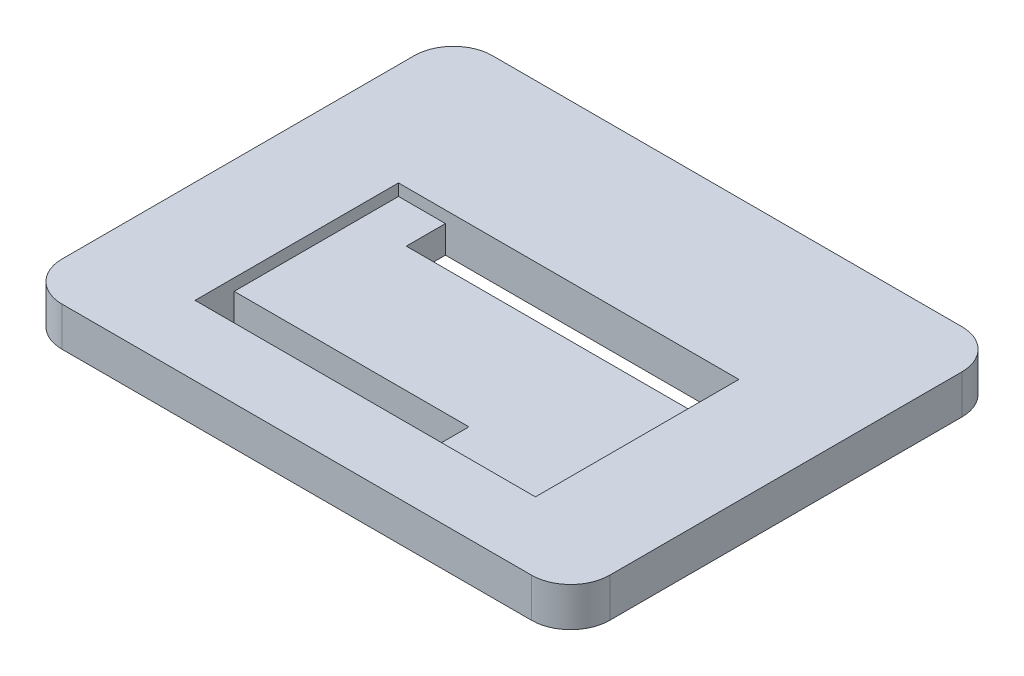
ISO-10303-21;
HEADER;
FILE_DESCRIPTION(('STEP AP214'),'2;1');
FILE_NAME('part.step','',(''),(''),'','','');
FILE_SCHEMA(('AUTOMOTIVE_DESIGN { 1 0 10303 214 1 1 1 1 }'));
ENDSEC;
DATA;
#1=APPLICATION_CONTEXT('core data for automotive mechanical design processes');
#2=APPLICATION_PROTOCOL_DEFINITION('international standard','automotive_design',2000,#1);
#3=PRODUCT_CONTEXT('',#1,'mechanical');
#4=PRODUCT('Part','Part','',(#3));
#5=PRODUCT_RELATED_PRODUCT_CATEGORY('part','',(#4));
#6=PRODUCT_DEFINITION_FORMATION('','',#4);
#7=PRODUCT_DEFINITION_CONTEXT('part definition',#1,'design');
#8=PRODUCT_DEFINITION('design','',#6,#7);
#9=PRODUCT_DEFINITION_SHAPE('','',#8);
#10=(LENGTH_UNIT() NAMED_UNIT(*) SI_UNIT(.MILLI.,.METRE.));
#11=(NAMED_UNIT(*) PLANE_ANGLE_UNIT() SI_UNIT($,.RADIAN.));
#12=(NAMED_UNIT(*) SI_UNIT($,.STERADIAN.) SOLID_ANGLE_UNIT());
#13=UNCERTAINTY_MEASURE_WITH_UNIT(LENGTH_MEASURE(1.E-05),#10,'distance_accuracy_value','');
#14=(GEOMETRIC_REPRESENTATION_CONTEXT(3) GLOBAL_UNCERTAINTY_ASSIGNED_CONTEXT((#13)) GLOBAL_UNIT_ASSIGNED_CONTEXT((#10,
#11,#12)) REPRESENTATION_CONTEXT('',''));
#15=CARTESIAN_POINT('',(0.,0.,0.));
#16=DIRECTION('',(0.,0.,1.));
#17=DIRECTION('',(1.,0.,0.));
#18=AXIS2_PLACEMENT_3D('',#15,#16,#17);
#19=CARTESIAN_POINT('',(-71.0763192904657,10.,-36.9348558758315));
#20=DIRECTION('',(1.,0.,0.));
#21=DIRECTION('',(0.,0.,-1.));
#22=AXIS2_PLACEMENT_3D('',#19,#20,#21);
#23=PLANE('',#22);
#24=DIRECTION('',(0.,0.,1.));
#25=VECTOR('',#24,1.);
#26=CARTESIAN_POINT('',(-71.0763192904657,0.,-36.9348558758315));
#27=LINE('',#26,#25);
#28=CARTESIAN_POINT('',(-71.0763192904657,0.,-26.9348558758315));
#29=VERTEX_POINT('',#28);
#30=CARTESIAN_POINT('',(-71.0763192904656,0.,63.0651441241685));
#31=VERTEX_POINT('',#30);
#32=EDGE_CURVE('E228',#29,#31,#27,.T.);
#33=ORIENTED_EDGE('',*,*,#32,.T.);
#34=DIRECTION('',(0.,-1.,0.));
#35=VECTOR('',#34,1.);
#36=CARTESIAN_POINT('',(-71.0763192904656,10.,63.0651441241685));
#37=LINE('',#36,#35);
#38=CARTESIAN_POINT('',(-71.0763192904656,10.,63.0651441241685));
#39=VERTEX_POINT('',#38);
#40=EDGE_CURVE('E291',#31,#39,#37,.F.);
#41=ORIENTED_EDGE('',*,*,#40,.T.);
#42=DIRECTION('',(0.,0.,1.));
#43=VECTOR('',#42,1.);
#44=CARTESIAN_POINT('',(-71.0763192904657,10.,-36.9348558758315));
#45=LINE('',#44,#43);
#46=CARTESIAN_POINT('',(-71.0763192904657,10.,-26.9348558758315));
#47=VERTEX_POINT('',#46);
#48=EDGE_CURVE('E237',#47,#39,#45,.T.);
#49=ORIENTED_EDGE('',*,*,#48,.F.);
#50=DIRECTION('',(0.,-1.,0.));
#51=VECTOR('',#50,1.);
#52=CARTESIAN_POINT('',(-71.0763192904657,10.,-26.9348558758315));
#53=LINE('',#52,#51);
#54=EDGE_CURVE('E287',#47,#29,#53,.T.);
#55=ORIENTED_EDGE('',*,*,#54,.T.);
#56=EDGE_LOOP('',(#33,#41,#49,#55));
#57=FACE_BOUND('',#56,.T.);
#58=ADVANCED_FACE('F43',(#57),#23,.F.);
#59=CARTESIAN_POINT('',(-71.0763192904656,10.,73.0651441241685));
#60=DIRECTION('',(0.,0.,-1.));
#61=DIRECTION('',(-1.,0.,0.));
#62=AXIS2_PLACEMENT_3D('',#59,#60,#61);
#63=PLANE('',#62);
#64=DIRECTION('',(1.,0.,0.));
#65=VECTOR('',#64,1.);
#66=CARTESIAN_POINT('',(-71.0763192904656,10.,73.0651441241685));
#67=LINE('',#66,#65);
#68=CARTESIAN_POINT('',(-61.0763192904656,10.,73.0651441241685));
#69=VERTEX_POINT('',#68);
#70=CARTESIAN_POINT('',(58.9036807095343,10.,73.0651441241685));
#71=VERTEX_POINT('',#70);
#72=EDGE_CURVE('E241',#69,#71,#67,.T.);
#73=ORIENTED_EDGE('',*,*,#72,.F.);
#74=DIRECTION('',(0.,-1.,0.));
#75=VECTOR('',#74,1.);
#76=CARTESIAN_POINT('',(-61.0763192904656,10.,73.0651441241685));
#77=LINE('',#76,#75);
#78=CARTESIAN_POINT('',(-61.0763192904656,0.,73.0651441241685));
#79=VERTEX_POINT('',#78);
#80=EDGE_CURVE('E271',#69,#79,#77,.T.);
#81=ORIENTED_EDGE('',*,*,#80,.T.);
#82=DIRECTION('',(1.,0.,0.));
#83=VECTOR('',#82,1.);
#84=CARTESIAN_POINT('',(-71.0763192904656,0.,73.0651441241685));
#85=LINE('',#84,#83);
#86=CARTESIAN_POINT('',(58.9036807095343,0.,73.0651441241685));
#87=VERTEX_POINT('',#86);
#88=EDGE_CURVE('E258',#79,#87,#85,.T.);
#89=ORIENTED_EDGE('',*,*,#88,.T.);
#90=DIRECTION('',(0.,-1.,0.));
#91=VECTOR('',#90,1.);
#92=CARTESIAN_POINT('',(58.9036807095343,10.,73.0651441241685));
#93=LINE('',#92,#91);
#94=EDGE_CURVE('E254',#87,#71,#93,.F.);
#95=ORIENTED_EDGE('',*,*,#94,.T.);
#96=EDGE_LOOP('',(#73,#81,#89,#95));
#97=FACE_BOUND('',#96,.T.);
#98=ADVANCED_FACE('F429',(#97),#63,.F.);
#99=CARTESIAN_POINT('',(68.9036807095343,10.,-36.9348558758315));
#100=DIRECTION('',(-1.,0.,0.));
#101=DIRECTION('',(0.,0.,1.));
#102=AXIS2_PLACEMENT_3D('',#99,#100,#101);
#103=PLANE('',#102);
#104=DIRECTION('',(0.,0.,-1.));
#105=VECTOR('',#104,1.);
#106=CARTESIAN_POINT('',(68.9036807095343,0.,-36.9348558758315));
#107=LINE('',#106,#105);
#108=CARTESIAN_POINT('',(68.9036807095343,0.,63.0651441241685));
#109=VERTEX_POINT('',#108);
#110=CARTESIAN_POINT('',(68.9036807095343,0.,-26.9348558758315));
#111=VERTEX_POINT('',#110);
#112=EDGE_CURVE('E262',#109,#111,#107,.T.);
#113=ORIENTED_EDGE('',*,*,#112,.T.);
#114=DIRECTION('',(0.,-1.,0.));
#115=VECTOR('',#114,1.);
#116=CARTESIAN_POINT('',(68.9036807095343,10.,-26.9348558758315));
#117=LINE('',#116,#115);
#118=CARTESIAN_POINT('',(68.9036807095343,10.,-26.9348558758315));
#119=VERTEX_POINT('',#118);
#120=EDGE_CURVE('E317',#111,#119,#117,.F.);
#121=ORIENTED_EDGE('',*,*,#120,.T.);
#122=DIRECTION('',(0.,0.,-1.));
#123=VECTOR('',#122,1.);
#124=CARTESIAN_POINT('',(68.9036807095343,10.,-36.9348558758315));
#125=LINE('',#124,#123);
#126=CARTESIAN_POINT('',(68.9036807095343,10.,63.0651441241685));
#127=VERTEX_POINT('',#126);
#128=EDGE_CURVE('E246',#127,#119,#125,.T.);
#129=ORIENTED_EDGE('',*,*,#128,.F.);
#130=DIRECTION('',(0.,-1.,0.));
#131=VECTOR('',#130,1.);
#132=CARTESIAN_POINT('',(68.9036807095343,10.,63.0651441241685));
#133=LINE('',#132,#131);
#134=EDGE_CURVE('E313',#127,#109,#133,.T.);
#135=ORIENTED_EDGE('',*,*,#134,.T.);
#136=EDGE_LOOP('',(#113,#121,#129,#135));
#137=FACE_BOUND('',#136,.T.);
#138=ADVANCED_FACE('F435',(#137),#103,.F.);
#139=CARTESIAN_POINT('',(-71.0763192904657,10.,-36.9348558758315));
#140=DIRECTION('',(0.,0.,1.));
#141=DIRECTION('',(1.,0.,0.));
#142=AXIS2_PLACEMENT_3D('',#139,#140,#141);
#143=PLANE('',#142);
#144=DIRECTION('',(-1.,0.,0.));
#145=VECTOR('',#144,1.);
#146=CARTESIAN_POINT('',(-71.0763192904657,0.,-36.9348558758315));
#147=LINE('',#146,#145);
#148=CARTESIAN_POINT('',(58.9036807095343,0.,-36.9348558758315));
#149=VERTEX_POINT('',#148);
#150=CARTESIAN_POINT('',(-61.0763192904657,0.,-36.9348558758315));
#151=VERTEX_POINT('',#150);
#152=EDGE_CURVE('E242',#149,#151,#147,.T.);
#153=ORIENTED_EDGE('',*,*,#152,.T.);
#154=DIRECTION('',(0.,-1.,0.));
#155=VECTOR('',#154,1.);
#156=CARTESIAN_POINT('',(-61.0763192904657,10.,-36.9348558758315));
#157=LINE('',#156,#155);
#158=CARTESIAN_POINT('',(-61.0763192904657,10.,-36.9348558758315));
#159=VERTEX_POINT('',#158);
#160=EDGE_CURVE('E310',#151,#159,#157,.F.);
#161=ORIENTED_EDGE('',*,*,#160,.T.);
#162=DIRECTION('',(-1.,0.,0.));
#163=VECTOR('',#162,1.);
#164=CARTESIAN_POINT('',(-71.0763192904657,10.,-36.9348558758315));
#165=LINE('',#164,#163);
#166=CARTESIAN_POINT('',(58.9036807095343,10.,-36.9348558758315));
#167=VERTEX_POINT('',#166);
#168=EDGE_CURVE('E250',#167,#159,#165,.T.);
#169=ORIENTED_EDGE('',*,*,#168,.F.);
#170=DIRECTION('',(0.,-1.,0.));
#171=VECTOR('',#170,1.);
#172=CARTESIAN_POINT('',(58.9036807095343,10.,-36.9348558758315));
#173=LINE('',#172,#171);
#174=EDGE_CURVE('E306',#167,#149,#173,.T.);
#175=ORIENTED_EDGE('',*,*,#174,.T.);
#176=EDGE_LOOP('',(#153,#161,#169,#175));
#177=FACE_BOUND('',#176,.T.);
#178=ADVANCED_FACE('F461',(#177),#143,.F.);
#179=CARTESIAN_POINT('',(0.,10.,0.));
#180=DIRECTION('',(0.,1.,0.));
#181=DIRECTION('',(0.,0.,1.));
#182=AXIS2_PLACEMENT_3D('',#179,#180,#181);
#183=PLANE('',#182);
#184=DIRECTION('',(1.,0.,0.));
#185=VECTOR('',#184,1.);
#186=CARTESIAN_POINT('',(-44.9244531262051,10.,55.2378384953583));
#187=LINE('',#186,#185);
#188=CARTESIAN_POINT('',(-44.9244531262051,10.,55.2378384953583));
#189=VERTEX_POINT('',#188);
#190=CARTESIAN_POINT('',(42.0755468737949,10.,55.2378384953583));
#191=VERTEX_POINT('',#190);
#192=EDGE_CURVE('E214',#189,#191,#187,.T.);
#193=ORIENTED_EDGE('',*,*,#192,.F.);
#194=DIRECTION('',(0.,0.,1.));
#195=VECTOR('',#194,1.);
#196=CARTESIAN_POINT('',(-44.9244531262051,10.,3.23783849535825));
#197=LINE('',#196,#195);
#198=CARTESIAN_POINT('',(-44.9244531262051,10.,3.23783849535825));
#199=VERTEX_POINT('',#198);
#200=EDGE_CURVE('E197',#199,#189,#197,.T.);
#201=ORIENTED_EDGE('',*,*,#200,.F.);
#202=DIRECTION('',(-1.,0.,0.));
#203=VECTOR('',#202,1.);
#204=CARTESIAN_POINT('',(-1.0863192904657,10.,3.23783849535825));
#205=LINE('',#204,#203);
#206=CARTESIAN_POINT('',(42.0755468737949,10.,3.23783849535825));
#207=VERTEX_POINT('',#206);
#208=EDGE_CURVE('E204',#207,#199,#205,.T.);
#209=ORIENTED_EDGE('',*,*,#208,.F.);
#210=DIRECTION('',(0.,0.,-1.));
#211=VECTOR('',#210,1.);
#212=CARTESIAN_POINT('',(42.0755468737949,10.,55.2378384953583));
#213=LINE('',#212,#211);
#214=EDGE_CURVE('E217',#191,#207,#213,.T.);
#215=ORIENTED_EDGE('',*,*,#214,.F.);
#216=EDGE_LOOP('',(#193,#201,#209,#215));
#217=FACE_BOUND('',#216,.T.);
#218=ORIENTED_EDGE('',*,*,#48,.T.);
#219=CARTESIAN_POINT('',(-61.0763192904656,10.,63.0651441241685));
#220=DIRECTION('',(0.,1.,0.));
#221=DIRECTION('',(0.,0.,1.));
#222=AXIS2_PLACEMENT_3D('',#219,#220,#221);
#223=CIRCLE('',#222,10.);
#224=EDGE_CURVE('E303',#39,#69,#223,.T.);
#225=ORIENTED_EDGE('',*,*,#224,.T.);
#226=ORIENTED_EDGE('',*,*,#72,.T.);
#227=CARTESIAN_POINT('',(58.9036807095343,10.,63.0651441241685));
#228=DIRECTION('',(0.,1.,0.));
#229=DIRECTION('',(0.,0.,1.));
#230=AXIS2_PLACEMENT_3D('',#227,#228,#229);
#231=CIRCLE('',#230,10.);
#232=EDGE_CURVE('E294',#71,#127,#231,.T.);
#233=ORIENTED_EDGE('',*,*,#232,.T.);
#234=ORIENTED_EDGE('',*,*,#128,.T.);
#235=CARTESIAN_POINT('',(58.9036807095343,10.,-26.9348558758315));
#236=DIRECTION('',(0.,1.,0.));
#237=DIRECTION('',(0.,0.,1.));
#238=AXIS2_PLACEMENT_3D('',#235,#236,#237);
#239=CIRCLE('',#238,10.);
#240=EDGE_CURVE('E297',#119,#167,#239,.T.);
#241=ORIENTED_EDGE('',*,*,#240,.T.);
#242=ORIENTED_EDGE('',*,*,#168,.T.);
#243=CARTESIAN_POINT('',(-61.0763192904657,10.,-26.9348558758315));
#244=DIRECTION('',(0.,1.,0.));
#245=DIRECTION('',(0.,0.,1.));
#246=AXIS2_PLACEMENT_3D('',#243,#244,#245);
#247=CIRCLE('',#246,10.);
#248=EDGE_CURVE('E300',#159,#47,#247,.T.);
#249=ORIENTED_EDGE('',*,*,#248,.T.);
#250=EDGE_LOOP('',(#218,#225,#226,#233,#234,#241,#242,#249));
#251=FACE_BOUND('',#250,.T.);
#252=ADVANCED_FACE('F409',(#217,#251),#183,.T.);
#253=CARTESIAN_POINT('',(0.,0.,0.));
#254=DIRECTION('',(0.,1.,0.));
#255=DIRECTION('',(0.,0.,1.));
#256=AXIS2_PLACEMENT_3D('',#253,#254,#255);
#257=PLANE('',#256);
#258=CARTESIAN_POINT('',(-64.6118531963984,0.,-30.4703897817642));
#259=DIRECTION('',(0.,-1.,0.));
#260=DIRECTION('',(0.,0.,-1.));
#261=AXIS2_PLACEMENT_3D('',#258,#259,#260);
#262=CIRCLE('',#261,3.5);
#263=CARTESIAN_POINT('',(-64.6118531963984,0.,-33.9703897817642));
#264=VERTEX_POINT('',#263);
#265=EDGE_CURVE('E384',#264,#264,#262,.T.);
#266=ORIENTED_EDGE('',*,*,#265,.F.);
#267=EDGE_LOOP('',(#266));
#268=FACE_BOUND('',#267,.T.);
#269=CARTESIAN_POINT('',(62.439214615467,0.,-30.4703897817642));
#270=DIRECTION('',(0.,-1.,0.));
#271=DIRECTION('',(0.,0.,-1.));
#272=AXIS2_PLACEMENT_3D('',#269,#270,#271);
#273=CIRCLE('',#272,3.49999999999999);
#274=CARTESIAN_POINT('',(62.439214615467,0.,-33.9703897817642));
#275=VERTEX_POINT('',#274);
#276=EDGE_CURVE('E392',#275,#275,#273,.T.);
#277=ORIENTED_EDGE('',*,*,#276,.F.);
#278=EDGE_LOOP('',(#277));
#279=FACE_BOUND('',#278,.T.);
#280=CARTESIAN_POINT('',(62.439214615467,0.,66.6006780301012));
#281=DIRECTION('',(0.,-1.,0.));
#282=DIRECTION('',(0.,0.,-1.));
#283=AXIS2_PLACEMENT_3D('',#280,#281,#282);
#284=CIRCLE('',#283,3.50000000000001);
#285=CARTESIAN_POINT('',(62.439214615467,0.,63.1006780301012));
#286=VERTEX_POINT('',#285);
#287=EDGE_CURVE('E376',#286,#286,#284,.T.);
#288=ORIENTED_EDGE('',*,*,#287,.F.);
#289=EDGE_LOOP('',(#288));
#290=FACE_BOUND('',#289,.T.);
#291=CARTESIAN_POINT('',(-64.6118531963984,0.,66.6006780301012));
#292=DIRECTION('',(0.,-1.,0.));
#293=DIRECTION('',(0.,0.,-1.));
#294=AXIS2_PLACEMENT_3D('',#291,#292,#293);
#295=CIRCLE('',#294,3.5);
#296=CARTESIAN_POINT('',(-64.6118531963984,0.,63.1006780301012));
#297=VERTEX_POINT('',#296);
#298=EDGE_CURVE('E372',#297,#297,#295,.T.);
#299=ORIENTED_EDGE('',*,*,#298,.F.);
#300=EDGE_LOOP('',(#299));
#301=FACE_BOUND('',#300,.T.);
#302=DIRECTION('',(-1.,0.,0.));
#303=VECTOR('',#302,1.);
#304=CARTESIAN_POINT('',(0.,0.,45.2378384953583));
#305=LINE('',#304,#303);
#306=CARTESIAN_POINT('',(15.0755468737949,0.,45.2378384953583));
#307=VERTEX_POINT('',#306);
#308=CARTESIAN_POINT('',(-44.9244531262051,0.,45.2378384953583));
#309=VERTEX_POINT('',#308);
#310=EDGE_CURVE('E52',#307,#309,#305,.T.);
#311=ORIENTED_EDGE('',*,*,#310,.T.);
#312=DIRECTION('',(0.,0.,1.));
#313=VECTOR('',#312,1.);
#314=CARTESIAN_POINT('',(-44.9244531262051,0.,0.));
#315=LINE('',#314,#313);
#316=CARTESIAN_POINT('',(-44.9244531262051,0.,55.2378384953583));
#317=VERTEX_POINT('',#316);
#318=EDGE_CURVE('E11',#309,#317,#315,.T.);
#319=ORIENTED_EDGE('',*,*,#318,.T.);
#320=DIRECTION('',(1.,0.,0.));
#321=VECTOR('',#320,1.);
#322=CARTESIAN_POINT('',(0.,0.,55.2378384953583));
#323=LINE('',#322,#321);
#324=CARTESIAN_POINT('',(15.0755468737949,0.,55.2378384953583));
#325=VERTEX_POINT('',#324);
#326=EDGE_CURVE('E336',#317,#325,#323,.T.);
#327=ORIENTED_EDGE('',*,*,#326,.T.);
#328=DIRECTION('',(0.,0.,-1.));
#329=VECTOR('',#328,1.);
#330=CARTESIAN_POINT('',(15.0755468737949,0.,0.));
#331=LINE('',#330,#329);
#332=EDGE_CURVE('E172',#325,#307,#331,.T.);
#333=ORIENTED_EDGE('',*,*,#332,.T.);
#334=EDGE_LOOP('',(#311,#319,#327,#333));
#335=FACE_BOUND('',#334,.T.);
#336=DIRECTION('',(1.,0.,0.));
#337=VECTOR('',#336,1.);
#338=CARTESIAN_POINT('',(0.,0.,13.2378384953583));
#339=LINE('',#338,#337);
#340=CARTESIAN_POINT('',(-32.9244531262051,0.,13.2378384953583));
#341=VERTEX_POINT('',#340);
#342=CARTESIAN_POINT('',(42.0755468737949,0.,13.2378384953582));
#343=VERTEX_POINT('',#342);
#344=EDGE_CURVE('E328',#341,#343,#339,.T.);
#345=ORIENTED_EDGE('',*,*,#344,.T.);
#346=DIRECTION('',(0.,0.,-1.));
#347=VECTOR('',#346,1.);
#348=CARTESIAN_POINT('',(42.0755468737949,0.,0.));
#349=LINE('',#348,#347);
#350=CARTESIAN_POINT('',(42.0755468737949,0.,3.23783849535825));
#351=VERTEX_POINT('',#350);
#352=EDGE_CURVE('E332',#343,#351,#349,.T.);
#353=ORIENTED_EDGE('',*,*,#352,.T.);
#354=DIRECTION('',(-1.,0.,0.));
#355=VECTOR('',#354,1.);
#356=CARTESIAN_POINT('',(0.,0.,3.23783849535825));
#357=LINE('',#356,#355);
#358=CARTESIAN_POINT('',(-32.9244531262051,0.,3.23783849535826));
#359=VERTEX_POINT('',#358);
#360=EDGE_CURVE('E320',#351,#359,#357,.T.);
#361=ORIENTED_EDGE('',*,*,#360,.T.);
#362=DIRECTION('',(0.,0.,1.));
#363=VECTOR('',#362,1.);
#364=CARTESIAN_POINT('',(-32.9244531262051,0.,0.));
#365=LINE('',#364,#363);
#366=EDGE_CURVE('E324',#359,#341,#365,.T.);
#367=ORIENTED_EDGE('',*,*,#366,.T.);
#368=EDGE_LOOP('',(#345,#353,#361,#367));
#369=FACE_BOUND('',#368,.T.);
#370=ORIENTED_EDGE('',*,*,#88,.F.);
#371=CARTESIAN_POINT('',(-61.0763192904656,0.,63.0651441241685));
#372=DIRECTION('',(0.,1.,0.));
#373=DIRECTION('',(0.,0.,1.));
#374=AXIS2_PLACEMENT_3D('',#371,#372,#373);
#375=CIRCLE('',#374,10.);
#376=EDGE_CURVE('E284',#79,#31,#375,.F.);
#377=ORIENTED_EDGE('',*,*,#376,.T.);
#378=ORIENTED_EDGE('',*,*,#32,.F.);
#379=CARTESIAN_POINT('',(-61.0763192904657,0.,-26.9348558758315));
#380=DIRECTION('',(0.,1.,0.));
#381=DIRECTION('',(0.,0.,1.));
#382=AXIS2_PLACEMENT_3D('',#379,#380,#381);
#383=CIRCLE('',#382,10.);
#384=EDGE_CURVE('E281',#29,#151,#383,.F.);
#385=ORIENTED_EDGE('',*,*,#384,.T.);
#386=ORIENTED_EDGE('',*,*,#152,.F.);
#387=CARTESIAN_POINT('',(58.9036807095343,0.,-26.9348558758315));
#388=DIRECTION('',(0.,1.,0.));
#389=DIRECTION('',(0.,0.,1.));
#390=AXIS2_PLACEMENT_3D('',#387,#388,#389);
#391=CIRCLE('',#390,10.);
#392=EDGE_CURVE('E278',#149,#111,#391,.F.);
#393=ORIENTED_EDGE('',*,*,#392,.T.);
#394=ORIENTED_EDGE('',*,*,#112,.F.);
#395=CARTESIAN_POINT('',(58.9036807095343,0.,63.0651441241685));
#396=DIRECTION('',(0.,1.,0.));
#397=DIRECTION('',(0.,0.,1.));
#398=AXIS2_PLACEMENT_3D('',#395,#396,#397);
#399=CIRCLE('',#398,10.);
#400=EDGE_CURVE('E275',#109,#87,#399,.F.);
#401=ORIENTED_EDGE('',*,*,#400,.T.);
#402=EDGE_LOOP('',(#370,#377,#378,#385,#386,#393,#394,#401));
#403=FACE_BOUND('',#402,.T.);
#404=ADVANCED_FACE('F343',(#268,#279,#290,#301,#335,#369,#403),#257,.F.);
#405=CARTESIAN_POINT('',(-61.0763192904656,10.,63.0651441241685));
#406=DIRECTION('',(0.,-1.,0.));
#407=DIRECTION('',(0.,0.,-1.));
#408=AXIS2_PLACEMENT_3D('',#405,#406,#407);
#409=CYLINDRICAL_SURFACE('',#408,10.);
#410=ORIENTED_EDGE('',*,*,#224,.F.);
#411=ORIENTED_EDGE('',*,*,#40,.F.);
#412=ORIENTED_EDGE('',*,*,#376,.F.);
#413=ORIENTED_EDGE('',*,*,#80,.F.);
#414=EDGE_LOOP('',(#410,#411,#412,#413));
#415=FACE_BOUND('',#414,.T.);
#416=ADVANCED_FACE('F408',(#415),#409,.T.);
#417=CARTESIAN_POINT('',(-61.0763192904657,10.,-26.9348558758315));
#418=DIRECTION('',(0.,-1.,0.));
#419=DIRECTION('',(0.,0.,-1.));
#420=AXIS2_PLACEMENT_3D('',#417,#418,#419);
#421=CYLINDRICAL_SURFACE('',#420,10.);
#422=ORIENTED_EDGE('',*,*,#248,.F.);
#423=ORIENTED_EDGE('',*,*,#160,.F.);
#424=ORIENTED_EDGE('',*,*,#384,.F.);
#425=ORIENTED_EDGE('',*,*,#54,.F.);
#426=EDGE_LOOP('',(#422,#423,#424,#425));
#427=FACE_BOUND('',#426,.T.);
#428=ADVANCED_FACE('F442',(#427),#421,.T.);
#429=CARTESIAN_POINT('',(58.9036807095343,10.,-26.9348558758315));
#430=DIRECTION('',(0.,-1.,0.));
#431=DIRECTION('',(0.,0.,-1.));
#432=AXIS2_PLACEMENT_3D('',#429,#430,#431);
#433=CYLINDRICAL_SURFACE('',#432,10.);
#434=ORIENTED_EDGE('',*,*,#240,.F.);
#435=ORIENTED_EDGE('',*,*,#120,.F.);
#436=ORIENTED_EDGE('',*,*,#392,.F.);
#437=ORIENTED_EDGE('',*,*,#174,.F.);
#438=EDGE_LOOP('',(#434,#435,#436,#437));
#439=FACE_BOUND('',#438,.T.);
#440=ADVANCED_FACE('F445',(#439),#433,.T.);
#441=CARTESIAN_POINT('',(58.9036807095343,10.,63.0651441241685));
#442=DIRECTION('',(0.,-1.,0.));
#443=DIRECTION('',(0.,0.,-1.));
#444=AXIS2_PLACEMENT_3D('',#441,#442,#443);
#445=CYLINDRICAL_SURFACE('',#444,10.);
#446=ORIENTED_EDGE('',*,*,#232,.F.);
#447=ORIENTED_EDGE('',*,*,#94,.F.);
#448=ORIENTED_EDGE('',*,*,#400,.F.);
#449=ORIENTED_EDGE('',*,*,#134,.F.);
#450=EDGE_LOOP('',(#446,#447,#448,#449));
#451=FACE_BOUND('',#450,.T.);
#452=ADVANCED_FACE('F45',(#451),#445,.T.);
#453=CARTESIAN_POINT('',(-44.9244531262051,7.,55.2378384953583));
#454=DIRECTION('',(0.,0.,1.));
#455=DIRECTION('',(1.,0.,0.));
#456=AXIS2_PLACEMENT_3D('',#453,#454,#455);
#457=PLANE('',#456);
#458=ORIENTED_EDGE('',*,*,#192,.T.);
#459=DIRECTION('',(0.,1.,0.));
#460=VECTOR('',#459,1.);
#461=CARTESIAN_POINT('',(42.0755468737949,7.,55.2378384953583));
#462=LINE('',#461,#460);
#463=CARTESIAN_POINT('',(42.0755468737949,7.,55.2378384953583));
#464=VERTEX_POINT('',#463);
#465=EDGE_CURVE('E193',#464,#191,#462,.T.);
#466=ORIENTED_EDGE('',*,*,#465,.F.);
#467=DIRECTION('',(1.,0.,0.));
#468=VECTOR('',#467,1.);
#469=CARTESIAN_POINT('',(-44.9244531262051,7.,55.2378384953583));
#470=LINE('',#469,#468);
#471=CARTESIAN_POINT('',(15.0755468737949,7.,55.2378384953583));
#472=VERTEX_POINT('',#471);
#473=EDGE_CURVE('E185',#472,#464,#470,.T.);
#474=ORIENTED_EDGE('',*,*,#473,.F.);
#475=DIRECTION('',(0.,1.,0.));
#476=VECTOR('',#475,1.);
#477=CARTESIAN_POINT('',(15.0755468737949,-10.,55.2378384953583));
#478=LINE('',#477,#476);
#479=EDGE_CURVE('E169',#325,#472,#478,.T.);
#480=ORIENTED_EDGE('',*,*,#479,.F.);
#481=ORIENTED_EDGE('',*,*,#326,.F.);
#482=DIRECTION('',(0.,1.,0.));
#483=VECTOR('',#482,1.);
#484=CARTESIAN_POINT('',(-44.9244531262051,7.,55.2378384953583));
#485=LINE('',#484,#483);
#486=EDGE_CURVE('E225',#317,#189,#485,.T.);
#487=ORIENTED_EDGE('',*,*,#486,.T.);
#488=EDGE_LOOP('',(#458,#466,#474,#480,#481,#487));
#489=FACE_BOUND('',#488,.T.);
#490=ADVANCED_FACE('F191',(#489),#457,.F.);
#491=CARTESIAN_POINT('',(-44.9244531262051,7.,3.23783849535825));
#492=DIRECTION('',(-1.,0.,0.));
#493=DIRECTION('',(0.,0.,1.));
#494=AXIS2_PLACEMENT_3D('',#491,#492,#493);
#495=PLANE('',#494);
#496=ORIENTED_EDGE('',*,*,#200,.T.);
#497=ORIENTED_EDGE('',*,*,#486,.F.);
#498=ORIENTED_EDGE('',*,*,#318,.F.);
#499=DIRECTION('',(0.,1.,0.));
#500=VECTOR('',#499,1.);
#501=CARTESIAN_POINT('',(-44.9244531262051,-10.,45.2378384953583));
#502=LINE('',#501,#500);
#503=CARTESIAN_POINT('',(-44.9244531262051,7.,45.2378384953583));
#504=VERTEX_POINT('',#503);
#505=EDGE_CURVE('E218',#309,#504,#502,.T.);
#506=ORIENTED_EDGE('',*,*,#505,.T.);
#507=DIRECTION('',(0.,0.,1.));
#508=VECTOR('',#507,1.);
#509=CARTESIAN_POINT('',(-44.9244531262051,7.,3.23783849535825));
#510=LINE('',#509,#508);
#511=CARTESIAN_POINT('',(-44.9244531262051,7.,3.23783849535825));
#512=VERTEX_POINT('',#511);
#513=EDGE_CURVE('E211',#512,#504,#510,.T.);
#514=ORIENTED_EDGE('',*,*,#513,.F.);
#515=DIRECTION('',(0.,1.,0.));
#516=VECTOR('',#515,1.);
#517=CARTESIAN_POINT('',(-44.9244531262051,7.,3.23783849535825));
#518=LINE('',#517,#516);
#519=EDGE_CURVE('E229',#512,#199,#518,.T.);
#520=ORIENTED_EDGE('',*,*,#519,.T.);
#521=EDGE_LOOP('',(#496,#497,#498,#506,#514,#520));
#522=FACE_BOUND('',#521,.T.);
#523=ADVANCED_FACE('F489',(#522),#495,.F.);
#524=CARTESIAN_POINT('',(-1.0863192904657,7.,3.23783849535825));
#525=DIRECTION('',(0.,0.,-1.));
#526=DIRECTION('',(-1.,0.,0.));
#527=AXIS2_PLACEMENT_3D('',#524,#525,#526);
#528=PLANE('',#527);
#529=ORIENTED_EDGE('',*,*,#208,.T.);
#530=ORIENTED_EDGE('',*,*,#519,.F.);
#531=DIRECTION('',(-1.,0.,0.));
#532=VECTOR('',#531,1.);
#533=CARTESIAN_POINT('',(-1.0863192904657,7.,3.23783849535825));
#534=LINE('',#533,#532);
#535=CARTESIAN_POINT('',(-32.9244531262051,7.,3.23783849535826));
#536=VERTEX_POINT('',#535);
#537=EDGE_CURVE('E201',#536,#512,#534,.T.);
#538=ORIENTED_EDGE('',*,*,#537,.F.);
#539=DIRECTION('',(0.,1.,0.));
#540=VECTOR('',#539,1.);
#541=CARTESIAN_POINT('',(-32.9244531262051,-10.,3.23783849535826));
#542=LINE('',#541,#540);
#543=EDGE_CURVE('E354',#359,#536,#542,.T.);
#544=ORIENTED_EDGE('',*,*,#543,.F.);
#545=ORIENTED_EDGE('',*,*,#360,.F.);
#546=DIRECTION('',(0.,1.,0.));
#547=VECTOR('',#546,1.);
#548=CARTESIAN_POINT('',(42.0755468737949,7.,3.23783849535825));
#549=LINE('',#548,#547);
#550=EDGE_CURVE('E232',#351,#207,#549,.T.);
#551=ORIENTED_EDGE('',*,*,#550,.T.);
#552=EDGE_LOOP('',(#529,#530,#538,#544,#545,#551));
#553=FACE_BOUND('',#552,.T.);
#554=ADVANCED_FACE('F493',(#553),#528,.F.);
#555=CARTESIAN_POINT('',(42.0755468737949,7.,55.2378384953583));
#556=DIRECTION('',(1.,0.,0.));
#557=DIRECTION('',(0.,0.,-1.));
#558=AXIS2_PLACEMENT_3D('',#555,#556,#557);
#559=PLANE('',#558);
#560=ORIENTED_EDGE('',*,*,#214,.T.);
#561=ORIENTED_EDGE('',*,*,#550,.F.);
#562=ORIENTED_EDGE('',*,*,#352,.F.);
#563=DIRECTION('',(0.,1.,0.));
#564=VECTOR('',#563,1.);
#565=CARTESIAN_POINT('',(42.0755468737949,-10.,13.2378384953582));
#566=LINE('',#565,#564);
#567=CARTESIAN_POINT('',(42.0755468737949,7.,13.2378384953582));
#568=VERTEX_POINT('',#567);
#569=EDGE_CURVE('E361',#343,#568,#566,.T.);
#570=ORIENTED_EDGE('',*,*,#569,.T.);
#571=DIRECTION('',(0.,0.,-1.));
#572=VECTOR('',#571,1.);
#573=CARTESIAN_POINT('',(42.0755468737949,7.,55.2378384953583));
#574=LINE('',#573,#572);
#575=EDGE_CURVE('E196',#464,#568,#574,.T.);
#576=ORIENTED_EDGE('',*,*,#575,.F.);
#577=ORIENTED_EDGE('',*,*,#465,.T.);
#578=EDGE_LOOP('',(#560,#561,#562,#570,#576,#577));
#579=FACE_BOUND('',#578,.T.);
#580=ADVANCED_FACE('F490',(#579),#559,.F.);
#581=CARTESIAN_POINT('',(0.,7.,0.));
#582=DIRECTION('',(0.,1.,0.));
#583=DIRECTION('',(0.,0.,1.));
#584=AXIS2_PLACEMENT_3D('',#581,#582,#583);
#585=PLANE('',#584);
#586=DIRECTION('',(0.,0.,-1.));
#587=VECTOR('',#586,1.);
#588=CARTESIAN_POINT('',(15.0755468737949,7.,55.2378384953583));
#589=LINE('',#588,#587);
#590=CARTESIAN_POINT('',(15.0755468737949,7.,45.2378384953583));
#591=VERTEX_POINT('',#590);
#592=EDGE_CURVE('E59',#472,#591,#589,.T.);
#593=ORIENTED_EDGE('',*,*,#592,.F.);
#594=ORIENTED_EDGE('',*,*,#473,.T.);
#595=ORIENTED_EDGE('',*,*,#575,.T.);
#596=DIRECTION('',(1.,0.,0.));
#597=VECTOR('',#596,1.);
#598=CARTESIAN_POINT('',(42.0755468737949,7.,13.2378384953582));
#599=LINE('',#598,#597);
#600=CARTESIAN_POINT('',(-32.9244531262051,7.,13.2378384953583));
#601=VERTEX_POINT('',#600);
#602=EDGE_CURVE('E357',#601,#568,#599,.T.);
#603=ORIENTED_EDGE('',*,*,#602,.F.);
#604=DIRECTION('',(0.,0.,1.));
#605=VECTOR('',#604,1.);
#606=CARTESIAN_POINT('',(-32.9244531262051,7.,3.23783849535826));
#607=LINE('',#606,#605);
#608=EDGE_CURVE('E67',#536,#601,#607,.T.);
#609=ORIENTED_EDGE('',*,*,#608,.F.);
#610=ORIENTED_EDGE('',*,*,#537,.T.);
#611=ORIENTED_EDGE('',*,*,#513,.T.);
#612=DIRECTION('',(-1.,0.,0.));
#613=VECTOR('',#612,1.);
#614=CARTESIAN_POINT('',(-44.9244531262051,7.,45.2378384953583));
#615=LINE('',#614,#613);
#616=EDGE_CURVE('E179',#591,#504,#615,.T.);
#617=ORIENTED_EDGE('',*,*,#616,.F.);
#618=EDGE_LOOP('',(#593,#594,#595,#603,#609,#610,#611,#617));
#619=FACE_BOUND('',#618,.T.);
#620=ADVANCED_FACE('F183',(#619),#585,.T.);
#621=CARTESIAN_POINT('',(42.0755468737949,-10.,13.2378384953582));
#622=DIRECTION('',(0.,0.,1.));
#623=DIRECTION('',(1.,0.,0.));
#624=AXIS2_PLACEMENT_3D('',#621,#622,#623);
#625=PLANE('',#624);
#626=DIRECTION('',(0.,1.,0.));
#627=VECTOR('',#626,1.);
#628=CARTESIAN_POINT('',(-32.9244531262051,-10.,13.2378384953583));
#629=LINE('',#628,#627);
#630=EDGE_CURVE('E358',#341,#601,#629,.T.);
#631=ORIENTED_EDGE('',*,*,#630,.T.);
#632=ORIENTED_EDGE('',*,*,#602,.T.);
#633=ORIENTED_EDGE('',*,*,#569,.F.);
#634=ORIENTED_EDGE('',*,*,#344,.F.);
#635=EDGE_LOOP('',(#631,#632,#633,#634));
#636=FACE_BOUND('',#635,.T.);
#637=ADVANCED_FACE('F503',(#636),#625,.F.);
#638=CARTESIAN_POINT('',(-32.9244531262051,-10.,3.23783849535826));
#639=DIRECTION('',(-1.,0.,0.));
#640=DIRECTION('',(0.,0.,1.));
#641=AXIS2_PLACEMENT_3D('',#638,#639,#640);
#642=PLANE('',#641);
#643=ORIENTED_EDGE('',*,*,#543,.T.);
#644=ORIENTED_EDGE('',*,*,#608,.T.);
#645=ORIENTED_EDGE('',*,*,#630,.F.);
#646=ORIENTED_EDGE('',*,*,#366,.F.);
#647=EDGE_LOOP('',(#643,#644,#645,#646));
#648=FACE_BOUND('',#647,.T.);
#649=ADVANCED_FACE('F506',(#648),#642,.F.);
#650=CARTESIAN_POINT('',(-44.9244531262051,-10.,45.2378384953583));
#651=DIRECTION('',(0.,0.,-1.));
#652=DIRECTION('',(-1.,0.,0.));
#653=AXIS2_PLACEMENT_3D('',#650,#651,#652);
#654=PLANE('',#653);
#655=DIRECTION('',(0.,1.,0.));
#656=VECTOR('',#655,1.);
#657=CARTESIAN_POINT('',(15.0755468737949,-10.,45.2378384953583));
#658=LINE('',#657,#656);
#659=EDGE_CURVE('E178',#307,#591,#658,.T.);
#660=ORIENTED_EDGE('',*,*,#659,.T.);
#661=ORIENTED_EDGE('',*,*,#616,.T.);
#662=ORIENTED_EDGE('',*,*,#505,.F.);
#663=ORIENTED_EDGE('',*,*,#310,.F.);
#664=EDGE_LOOP('',(#660,#661,#662,#663));
#665=FACE_BOUND('',#664,.T.);
#666=ADVANCED_FACE('F347',(#665),#654,.F.);
#667=CARTESIAN_POINT('',(15.0755468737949,-10.,55.2378384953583));
#668=DIRECTION('',(1.,0.,0.));
#669=DIRECTION('',(0.,0.,-1.));
#670=AXIS2_PLACEMENT_3D('',#667,#668,#669);
#671=PLANE('',#670);
#672=ORIENTED_EDGE('',*,*,#479,.T.);
#673=ORIENTED_EDGE('',*,*,#592,.T.);
#674=ORIENTED_EDGE('',*,*,#659,.F.);
#675=ORIENTED_EDGE('',*,*,#332,.F.);
#676=EDGE_LOOP('',(#672,#673,#674,#675));
#677=FACE_BOUND('',#676,.T.);
#678=ADVANCED_FACE('F170',(#677),#671,.F.);
#679=CARTESIAN_POINT('',(-64.6118531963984,6.,66.6006780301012));
#680=DIRECTION('',(0.,-1.,0.));
#681=DIRECTION('',(0.,0.,-1.));
#682=AXIS2_PLACEMENT_3D('',#679,#680,#681);
#683=CYLINDRICAL_SURFACE('',#682,3.5);
#684=CARTESIAN_POINT('',(-64.6118531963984,6.,66.6006780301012));
#685=DIRECTION('',(0.,-1.,0.));
#686=DIRECTION('',(0.,0.,-1.));
#687=AXIS2_PLACEMENT_3D('',#684,#685,#686);
#688=CIRCLE('',#687,3.5);
#689=CARTESIAN_POINT('',(-64.6118531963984,6.,63.1006780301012));
#690=VERTEX_POINT('',#689);
#691=EDGE_CURVE('E363',#690,#690,#688,.T.);
#692=ORIENTED_EDGE('',*,*,#691,.F.);
#693=EDGE_LOOP('',(#692));
#694=FACE_BOUND('',#693,.T.);
#695=ORIENTED_EDGE('',*,*,#298,.T.);
#696=EDGE_LOOP('',(#695));
#697=FACE_BOUND('',#696,.T.);
#698=ADVANCED_FACE('F414',(#694,#697),#683,.F.);
#699=CARTESIAN_POINT('',(-64.6118531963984,6.,66.6006780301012));
#700=DIRECTION('',(0.,-1.,0.));
#701=DIRECTION('',(0.,0.,-1.));
#702=AXIS2_PLACEMENT_3D('',#699,#700,#701);
#703=PLANE('',#702);
#704=ORIENTED_EDGE('',*,*,#691,.T.);
#705=EDGE_LOOP('',(#704));
#706=FACE_BOUND('',#705,.T.);
#707=ADVANCED_FACE('F416',(#706),#703,.T.);
#708=CARTESIAN_POINT('',(62.439214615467,6.,66.6006780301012));
#709=DIRECTION('',(0.,-1.,0.));
#710=DIRECTION('',(0.,0.,-1.));
#711=AXIS2_PLACEMENT_3D('',#708,#709,#710);
#712=CYLINDRICAL_SURFACE('',#711,3.50000000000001);
#713=CARTESIAN_POINT('',(62.439214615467,6.,66.6006780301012));
#714=DIRECTION('',(0.,-1.,0.));
#715=DIRECTION('',(0.,0.,-1.));
#716=AXIS2_PLACEMENT_3D('',#713,#714,#715);
#717=CIRCLE('',#716,3.50000000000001);
#718=CARTESIAN_POINT('',(62.439214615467,6.,63.1006780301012));
#719=VERTEX_POINT('',#718);
#720=EDGE_CURVE('E396',#719,#719,#717,.T.);
#721=ORIENTED_EDGE('',*,*,#720,.F.);
#722=EDGE_LOOP('',(#721));
#723=FACE_BOUND('',#722,.T.);
#724=ORIENTED_EDGE('',*,*,#287,.T.);
#725=EDGE_LOOP('',(#724));
#726=FACE_BOUND('',#725,.T.);
#727=ADVANCED_FACE('F404',(#723,#726),#712,.F.);
#728=CARTESIAN_POINT('',(62.439214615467,6.,66.6006780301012));
#729=DIRECTION('',(0.,-1.,0.));
#730=DIRECTION('',(0.,0.,-1.));
#731=AXIS2_PLACEMENT_3D('',#728,#729,#730);
#732=PLANE('',#731);
#733=ORIENTED_EDGE('',*,*,#720,.T.);
#734=EDGE_LOOP('',(#733));
#735=FACE_BOUND('',#734,.T.);
#736=ADVANCED_FACE('F548',(#735),#732,.T.);
#737=CARTESIAN_POINT('',(62.439214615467,6.,-30.4703897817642));
#738=DIRECTION('',(0.,-1.,0.));
#739=DIRECTION('',(0.,0.,-1.));
#740=AXIS2_PLACEMENT_3D('',#737,#738,#739);
#741=CYLINDRICAL_SURFACE('',#740,3.49999999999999);
#742=CARTESIAN_POINT('',(62.439214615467,6.,-30.4703897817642));
#743=DIRECTION('',(0.,-1.,0.));
#744=DIRECTION('',(0.,0.,-1.));
#745=AXIS2_PLACEMENT_3D('',#742,#743,#744);
#746=CIRCLE('',#745,3.49999999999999);
#747=CARTESIAN_POINT('',(62.439214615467,6.,-33.9703897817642));
#748=VERTEX_POINT('',#747);
#749=EDGE_CURVE('E388',#748,#748,#746,.T.);
#750=ORIENTED_EDGE('',*,*,#749,.F.);
#751=EDGE_LOOP('',(#750));
#752=FACE_BOUND('',#751,.T.);
#753=ORIENTED_EDGE('',*,*,#276,.T.);
#754=EDGE_LOOP('',(#753));
#755=FACE_BOUND('',#754,.T.);
#756=ADVANCED_FACE('F559',(#752,#755),#741,.F.);
#757=CARTESIAN_POINT('',(62.439214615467,6.,-30.4703897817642));
#758=DIRECTION('',(0.,-1.,0.));
#759=DIRECTION('',(0.,0.,-1.));
#760=AXIS2_PLACEMENT_3D('',#757,#758,#759);
#761=PLANE('',#760);
#762=ORIENTED_EDGE('',*,*,#749,.T.);
#763=EDGE_LOOP('',(#762));
#764=FACE_BOUND('',#763,.T.);
#765=ADVANCED_FACE('F570',(#764),#761,.T.);
#766=CARTESIAN_POINT('',(-64.6118531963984,6.,-30.4703897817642));
#767=DIRECTION('',(0.,-1.,0.));
#768=DIRECTION('',(0.,0.,-1.));
#769=AXIS2_PLACEMENT_3D('',#766,#767,#768);
#770=CYLINDRICAL_SURFACE('',#769,3.5);
#771=CARTESIAN_POINT('',(-64.6118531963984,6.,-30.4703897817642));
#772=DIRECTION('',(0.,-1.,0.));
#773=DIRECTION('',(0.,0.,-1.));
#774=AXIS2_PLACEMENT_3D('',#771,#772,#773);
#775=CIRCLE('',#774,3.5);
#776=CARTESIAN_POINT('',(-64.6118531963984,6.,-33.9703897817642));
#777=VERTEX_POINT('',#776);
#778=EDGE_CURVE('E380',#777,#777,#775,.T.);
#779=ORIENTED_EDGE('',*,*,#778,.F.);
#780=EDGE_LOOP('',(#779));
#781=FACE_BOUND('',#780,.T.);
#782=ORIENTED_EDGE('',*,*,#265,.T.);
#783=EDGE_LOOP('',(#782));
#784=FACE_BOUND('',#783,.T.);
#785=ADVANCED_FACE('F581',(#781,#784),#770,.F.);
#786=CARTESIAN_POINT('',(-64.6118531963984,6.,-30.4703897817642));
#787=DIRECTION('',(0.,-1.,0.));
#788=DIRECTION('',(0.,0.,-1.));
#789=AXIS2_PLACEMENT_3D('',#786,#787,#788);
#790=PLANE('',#789);
#791=ORIENTED_EDGE('',*,*,#778,.T.);
#792=EDGE_LOOP('',(#791));
#793=FACE_BOUND('',#792,.T.);
#794=ADVANCED_FACE('F592',(#793),#790,.T.);
#795=CLOSED_SHELL('',(#58,#98,#138,#178,#252,#404,#416,#428,#440,#452,#490,#523,#554,#580,#620,
#637,#649,#666,#678,#698,#707,#727,#736,#756,#765,#785,#794));
#796=MANIFOLD_SOLID_BREP('B2',#795);
#797=ADVANCED_BREP_SHAPE_REPRESENTATION('',(#18,#796),#14);
#798=SHAPE_DEFINITION_REPRESENTATION(#9,#797);
ENDSEC;
END-ISO-10303-21;
